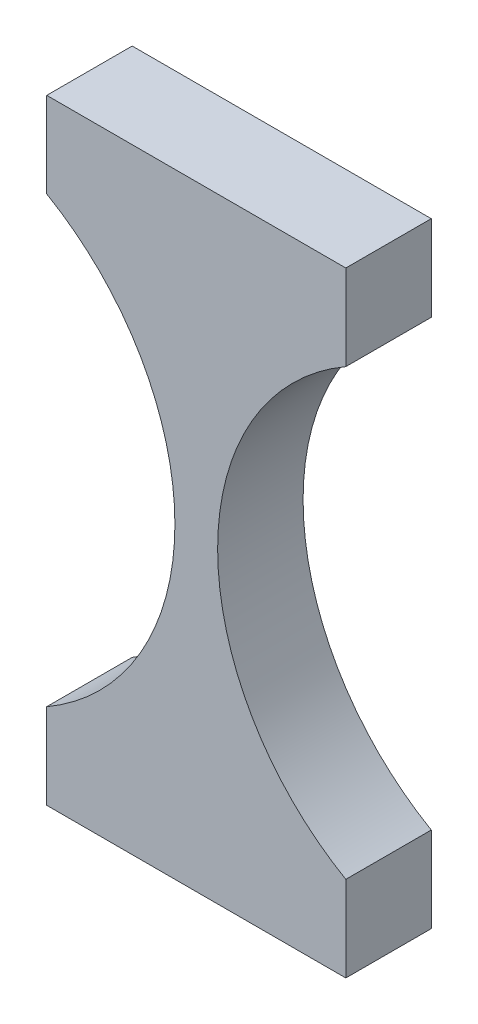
ISO-10303-21;
HEADER;
FILE_DESCRIPTION(('STEP AP214'),'2;1');
FILE_NAME('part.step','',(''),(''),'','','');
FILE_SCHEMA(('AUTOMOTIVE_DESIGN { 1 0 10303 214 1 1 1 1 }'));
ENDSEC;
DATA;
#1=APPLICATION_CONTEXT('core data for automotive mechanical design processes');
#2=APPLICATION_PROTOCOL_DEFINITION('international standard','automotive_design',2000,#1);
#3=PRODUCT_CONTEXT('',#1,'mechanical');
#4=PRODUCT('Part','Part','',(#3));
#5=PRODUCT_RELATED_PRODUCT_CATEGORY('part','',(#4));
#6=PRODUCT_DEFINITION_FORMATION('','',#4);
#7=PRODUCT_DEFINITION_CONTEXT('part definition',#1,'design');
#8=PRODUCT_DEFINITION('design','',#6,#7);
#9=PRODUCT_DEFINITION_SHAPE('','',#8);
#10=(LENGTH_UNIT() NAMED_UNIT(*) SI_UNIT(.MILLI.,.METRE.));
#11=(NAMED_UNIT(*) PLANE_ANGLE_UNIT() SI_UNIT($,.RADIAN.));
#12=(NAMED_UNIT(*) SI_UNIT($,.STERADIAN.) SOLID_ANGLE_UNIT());
#13=UNCERTAINTY_MEASURE_WITH_UNIT(LENGTH_MEASURE(1.E-05),#10,'distance_accuracy_value','');
#14=(GEOMETRIC_REPRESENTATION_CONTEXT(3) GLOBAL_UNCERTAINTY_ASSIGNED_CONTEXT((#13)) GLOBAL_UNIT_ASSIGNED_CONTEXT((#10,
#11,#12)) REPRESENTATION_CONTEXT('',''));
#15=CARTESIAN_POINT('',(0.,0.,0.));
#16=DIRECTION('',(0.,0.,1.));
#17=DIRECTION('',(1.,0.,0.));
#18=AXIS2_PLACEMENT_3D('',#15,#16,#17);
#19=CARTESIAN_POINT('',(-3.25,0.,1.));
#20=DIRECTION('',(0.,0.,-1.));
#21=DIRECTION('',(-1.,0.,0.));
#22=AXIS2_PLACEMENT_3D('',#19,#20,#21);
#23=CYLINDRICAL_SURFACE('',#22,3.);
#24=CARTESIAN_POINT('',(-3.25,0.,0.));
#25=DIRECTION('',(0.,0.,-1.));
#26=DIRECTION('',(-1.,0.,0.));
#27=AXIS2_PLACEMENT_3D('',#24,#25,#26);
#28=CIRCLE('',#27,3.);
#29=CARTESIAN_POINT('',(-1.75,2.59807621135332,0.));
#30=VERTEX_POINT('',#29);
#31=CARTESIAN_POINT('',(-1.75,-2.59807621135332,0.));
#32=VERTEX_POINT('',#31);
#33=EDGE_CURVE('E140',#30,#32,#28,.T.);
#34=ORIENTED_EDGE('',*,*,#33,.T.);
#35=DIRECTION('',(0.,0.,-1.));
#36=VECTOR('',#35,1.);
#37=CARTESIAN_POINT('',(-1.75,-2.59807621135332,1.));
#38=LINE('',#37,#36);
#39=CARTESIAN_POINT('',(-1.75,-2.59807621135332,1.));
#40=VERTEX_POINT('',#39);
#41=EDGE_CURVE('E11',#40,#32,#38,.T.);
#42=ORIENTED_EDGE('',*,*,#41,.F.);
#43=CARTESIAN_POINT('',(-3.25,0.,1.));
#44=DIRECTION('',(0.,0.,-1.));
#45=DIRECTION('',(-1.,0.,0.));
#46=AXIS2_PLACEMENT_3D('',#43,#44,#45);
#47=CIRCLE('',#46,3.);
#48=CARTESIAN_POINT('',(-1.75,2.59807621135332,1.));
#49=VERTEX_POINT('',#48);
#50=EDGE_CURVE('E162',#49,#40,#47,.T.);
#51=ORIENTED_EDGE('',*,*,#50,.F.);
#52=DIRECTION('',(0.,0.,-1.));
#53=VECTOR('',#52,1.);
#54=CARTESIAN_POINT('',(-1.75,2.59807621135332,1.));
#55=LINE('',#54,#53);
#56=EDGE_CURVE('E136',#49,#30,#55,.T.);
#57=ORIENTED_EDGE('',*,*,#56,.T.);
#58=EDGE_LOOP('',(#34,#42,#51,#57));
#59=FACE_BOUND('',#58,.T.);
#60=ADVANCED_FACE('F39',(#59),#23,.F.);
#61=CARTESIAN_POINT('',(-1.75,-2.59807621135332,1.));
#62=DIRECTION('',(1.,0.,0.));
#63=DIRECTION('',(0.,1.,0.));
#64=AXIS2_PLACEMENT_3D('',#61,#62,#63);
#65=PLANE('',#64);
#66=DIRECTION('',(0.,-1.,0.));
#67=VECTOR('',#66,1.);
#68=CARTESIAN_POINT('',(-1.75,-2.59807621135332,0.));
#69=LINE('',#68,#67);
#70=CARTESIAN_POINT('',(-1.75,-3.59807621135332,0.));
#71=VERTEX_POINT('',#70);
#72=EDGE_CURVE('E144',#32,#71,#69,.T.);
#73=ORIENTED_EDGE('',*,*,#72,.T.);
#74=DIRECTION('',(0.,0.,-1.));
#75=VECTOR('',#74,1.);
#76=CARTESIAN_POINT('',(-1.75,-3.59807621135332,1.));
#77=LINE('',#76,#75);
#78=CARTESIAN_POINT('',(-1.75,-3.59807621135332,1.));
#79=VERTEX_POINT('',#78);
#80=EDGE_CURVE('E48',#79,#71,#77,.T.);
#81=ORIENTED_EDGE('',*,*,#80,.F.);
#82=DIRECTION('',(0.,-1.,0.));
#83=VECTOR('',#82,1.);
#84=CARTESIAN_POINT('',(-1.75,-2.59807621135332,1.));
#85=LINE('',#84,#83);
#86=EDGE_CURVE('E99',#40,#79,#85,.T.);
#87=ORIENTED_EDGE('',*,*,#86,.F.);
#88=ORIENTED_EDGE('',*,*,#41,.T.);
#89=EDGE_LOOP('',(#73,#81,#87,#88));
#90=FACE_BOUND('',#89,.T.);
#91=ADVANCED_FACE('F208',(#90),#65,.F.);
#92=CARTESIAN_POINT('',(-1.75,-3.59807621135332,1.));
#93=DIRECTION('',(0.,1.,0.));
#94=DIRECTION('',(0.,0.,1.));
#95=AXIS2_PLACEMENT_3D('',#92,#93,#94);
#96=PLANE('',#95);
#97=DIRECTION('',(1.,0.,0.));
#98=VECTOR('',#97,1.);
#99=CARTESIAN_POINT('',(-1.75,-3.59807621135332,0.));
#100=LINE('',#99,#98);
#101=CARTESIAN_POINT('',(1.75,-3.59807621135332,0.));
#102=VERTEX_POINT('',#101);
#103=EDGE_CURVE('E147',#71,#102,#100,.T.);
#104=ORIENTED_EDGE('',*,*,#103,.T.);
#105=DIRECTION('',(0.,0.,-1.));
#106=VECTOR('',#105,1.);
#107=CARTESIAN_POINT('',(1.75,-3.59807621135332,1.));
#108=LINE('',#107,#106);
#109=CARTESIAN_POINT('',(1.75,-3.59807621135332,1.));
#110=VERTEX_POINT('',#109);
#111=EDGE_CURVE('E173',#110,#102,#108,.T.);
#112=ORIENTED_EDGE('',*,*,#111,.F.);
#113=DIRECTION('',(1.,0.,0.));
#114=VECTOR('',#113,1.);
#115=CARTESIAN_POINT('',(-1.75,-3.59807621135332,1.));
#116=LINE('',#115,#114);
#117=EDGE_CURVE('E183',#79,#110,#116,.T.);
#118=ORIENTED_EDGE('',*,*,#117,.F.);
#119=ORIENTED_EDGE('',*,*,#80,.T.);
#120=EDGE_LOOP('',(#104,#112,#118,#119));
#121=FACE_BOUND('',#120,.T.);
#122=ADVANCED_FACE('F181',(#121),#96,.F.);
#123=CARTESIAN_POINT('',(1.75,-2.59807621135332,1.));
#124=DIRECTION('',(-1.,0.,0.));
#125=DIRECTION('',(0.,-1.,0.));
#126=AXIS2_PLACEMENT_3D('',#123,#124,#125);
#127=PLANE('',#126);
#128=DIRECTION('',(0.,1.,0.));
#129=VECTOR('',#128,1.);
#130=CARTESIAN_POINT('',(1.75,-2.59807621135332,0.));
#131=LINE('',#130,#129);
#132=CARTESIAN_POINT('',(1.75,-2.59807621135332,0.));
#133=VERTEX_POINT('',#132);
#134=EDGE_CURVE('E150',#102,#133,#131,.T.);
#135=ORIENTED_EDGE('',*,*,#134,.T.);
#136=DIRECTION('',(0.,0.,-1.));
#137=VECTOR('',#136,1.);
#138=CARTESIAN_POINT('',(1.75,-2.59807621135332,1.));
#139=LINE('',#138,#137);
#140=CARTESIAN_POINT('',(1.75,-2.59807621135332,1.));
#141=VERTEX_POINT('',#140);
#142=EDGE_CURVE('E169',#141,#133,#139,.T.);
#143=ORIENTED_EDGE('',*,*,#142,.F.);
#144=DIRECTION('',(0.,1.,0.));
#145=VECTOR('',#144,1.);
#146=CARTESIAN_POINT('',(1.75,-2.59807621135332,1.));
#147=LINE('',#146,#145);
#148=EDGE_CURVE('E196',#110,#141,#147,.T.);
#149=ORIENTED_EDGE('',*,*,#148,.F.);
#150=ORIENTED_EDGE('',*,*,#111,.T.);
#151=EDGE_LOOP('',(#135,#143,#149,#150));
#152=FACE_BOUND('',#151,.T.);
#153=ADVANCED_FACE('F191',(#152),#127,.F.);
#154=CARTESIAN_POINT('',(3.25,0.,1.));
#155=DIRECTION('',(0.,0.,-1.));
#156=DIRECTION('',(-1.,0.,0.));
#157=AXIS2_PLACEMENT_3D('',#154,#155,#156);
#158=CYLINDRICAL_SURFACE('',#157,3.);
#159=CARTESIAN_POINT('',(3.25,0.,0.));
#160=DIRECTION('',(0.,0.,-1.));
#161=DIRECTION('',(1.,0.,0.));
#162=AXIS2_PLACEMENT_3D('',#159,#160,#161);
#163=CIRCLE('',#162,3.);
#164=CARTESIAN_POINT('',(1.75,2.59807621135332,0.));
#165=VERTEX_POINT('',#164);
#166=EDGE_CURVE('E153',#133,#165,#163,.T.);
#167=ORIENTED_EDGE('',*,*,#166,.T.);
#168=DIRECTION('',(0.,0.,-1.));
#169=VECTOR('',#168,1.);
#170=CARTESIAN_POINT('',(1.75,2.59807621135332,1.));
#171=LINE('',#170,#169);
#172=CARTESIAN_POINT('',(1.75,2.59807621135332,1.));
#173=VERTEX_POINT('',#172);
#174=EDGE_CURVE('E129',#173,#165,#171,.T.);
#175=ORIENTED_EDGE('',*,*,#174,.F.);
#176=CARTESIAN_POINT('',(3.25,0.,1.));
#177=DIRECTION('',(0.,0.,-1.));
#178=DIRECTION('',(1.,0.,0.));
#179=AXIS2_PLACEMENT_3D('',#176,#177,#178);
#180=CIRCLE('',#179,3.);
#181=EDGE_CURVE('E118',#141,#173,#180,.T.);
#182=ORIENTED_EDGE('',*,*,#181,.F.);
#183=ORIENTED_EDGE('',*,*,#142,.T.);
#184=EDGE_LOOP('',(#167,#175,#182,#183));
#185=FACE_BOUND('',#184,.T.);
#186=ADVANCED_FACE('F194',(#185),#158,.F.);
#187=CARTESIAN_POINT('',(1.75,3.59807621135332,1.));
#188=DIRECTION('',(-1.,0.,0.));
#189=DIRECTION('',(0.,-1.,0.));
#190=AXIS2_PLACEMENT_3D('',#187,#188,#189);
#191=PLANE('',#190);
#192=DIRECTION('',(0.,1.,0.));
#193=VECTOR('',#192,1.);
#194=CARTESIAN_POINT('',(1.75,3.59807621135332,0.));
#195=LINE('',#194,#193);
#196=CARTESIAN_POINT('',(1.75,3.59807621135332,0.));
#197=VERTEX_POINT('',#196);
#198=EDGE_CURVE('E127',#165,#197,#195,.T.);
#199=ORIENTED_EDGE('',*,*,#198,.T.);
#200=DIRECTION('',(0.,0.,-1.));
#201=VECTOR('',#200,1.);
#202=CARTESIAN_POINT('',(1.75,3.59807621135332,1.));
#203=LINE('',#202,#201);
#204=CARTESIAN_POINT('',(1.75,3.59807621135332,1.));
#205=VERTEX_POINT('',#204);
#206=EDGE_CURVE('E124',#205,#197,#203,.T.);
#207=ORIENTED_EDGE('',*,*,#206,.F.);
#208=DIRECTION('',(0.,1.,0.));
#209=VECTOR('',#208,1.);
#210=CARTESIAN_POINT('',(1.75,3.59807621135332,1.));
#211=LINE('',#210,#209);
#212=EDGE_CURVE('E112',#173,#205,#211,.T.);
#213=ORIENTED_EDGE('',*,*,#212,.F.);
#214=ORIENTED_EDGE('',*,*,#174,.T.);
#215=EDGE_LOOP('',(#199,#207,#213,#214));
#216=FACE_BOUND('',#215,.T.);
#217=ADVANCED_FACE('F125',(#216),#191,.F.);
#218=CARTESIAN_POINT('',(-1.75,3.59807621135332,1.));
#219=DIRECTION('',(0.,-1.,0.));
#220=DIRECTION('',(0.,0.,-1.));
#221=AXIS2_PLACEMENT_3D('',#218,#219,#220);
#222=PLANE('',#221);
#223=DIRECTION('',(-1.,0.,0.));
#224=VECTOR('',#223,1.);
#225=CARTESIAN_POINT('',(-1.75,3.59807621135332,0.));
#226=LINE('',#225,#224);
#227=CARTESIAN_POINT('',(-1.75,3.59807621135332,0.));
#228=VERTEX_POINT('',#227);
#229=EDGE_CURVE('E85',#197,#228,#226,.T.);
#230=ORIENTED_EDGE('',*,*,#229,.T.);
#231=DIRECTION('',(0.,0.,-1.));
#232=VECTOR('',#231,1.);
#233=CARTESIAN_POINT('',(-1.75,3.59807621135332,1.));
#234=LINE('',#233,#232);
#235=CARTESIAN_POINT('',(-1.75,3.59807621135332,1.));
#236=VERTEX_POINT('',#235);
#237=EDGE_CURVE('E130',#236,#228,#234,.T.);
#238=ORIENTED_EDGE('',*,*,#237,.F.);
#239=DIRECTION('',(-1.,0.,0.));
#240=VECTOR('',#239,1.);
#241=CARTESIAN_POINT('',(-1.75,3.59807621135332,1.));
#242=LINE('',#241,#240);
#243=EDGE_CURVE('E116',#205,#236,#242,.T.);
#244=ORIENTED_EDGE('',*,*,#243,.F.);
#245=ORIENTED_EDGE('',*,*,#206,.T.);
#246=EDGE_LOOP('',(#230,#238,#244,#245));
#247=FACE_BOUND('',#246,.T.);
#248=ADVANCED_FACE('F132',(#247),#222,.F.);
#249=CARTESIAN_POINT('',(-1.75,3.59807621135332,1.));
#250=DIRECTION('',(1.,0.,0.));
#251=DIRECTION('',(0.,1.,0.));
#252=AXIS2_PLACEMENT_3D('',#249,#250,#251);
#253=PLANE('',#252);
#254=DIRECTION('',(0.,-1.,0.));
#255=VECTOR('',#254,1.);
#256=CARTESIAN_POINT('',(-1.75,3.59807621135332,0.));
#257=LINE('',#256,#255);
#258=EDGE_CURVE('E91',#228,#30,#257,.T.);
#259=ORIENTED_EDGE('',*,*,#258,.T.);
#260=ORIENTED_EDGE('',*,*,#56,.F.);
#261=DIRECTION('',(0.,-1.,0.));
#262=VECTOR('',#261,1.);
#263=CARTESIAN_POINT('',(-1.75,3.59807621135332,1.));
#264=LINE('',#263,#262);
#265=EDGE_CURVE('E56',#236,#49,#264,.T.);
#266=ORIENTED_EDGE('',*,*,#265,.F.);
#267=ORIENTED_EDGE('',*,*,#237,.T.);
#268=EDGE_LOOP('',(#259,#260,#266,#267));
#269=FACE_BOUND('',#268,.T.);
#270=ADVANCED_FACE('F224',(#269),#253,.F.);
#271=CARTESIAN_POINT('',(-3.25,0.,1.));
#272=DIRECTION('',(0.,0.,-1.));
#273=DIRECTION('',(-1.,0.,0.));
#274=AXIS2_PLACEMENT_3D('',#271,#272,#273);
#275=PLANE('',#274);
#276=ORIENTED_EDGE('',*,*,#50,.T.);
#277=ORIENTED_EDGE('',*,*,#86,.T.);
#278=ORIENTED_EDGE('',*,*,#117,.T.);
#279=ORIENTED_EDGE('',*,*,#148,.T.);
#280=ORIENTED_EDGE('',*,*,#181,.T.);
#281=ORIENTED_EDGE('',*,*,#212,.T.);
#282=ORIENTED_EDGE('',*,*,#243,.T.);
#283=ORIENTED_EDGE('',*,*,#265,.T.);
#284=EDGE_LOOP('',(#276,#277,#278,#279,#280,#281,#282,#283));
#285=FACE_BOUND('',#284,.T.);
#286=ADVANCED_FACE('F114',(#285),#275,.F.);
#287=CARTESIAN_POINT('',(-3.25,0.,0.));
#288=DIRECTION('',(0.,0.,-1.));
#289=DIRECTION('',(-1.,0.,0.));
#290=AXIS2_PLACEMENT_3D('',#287,#288,#289);
#291=PLANE('',#290);
#292=ORIENTED_EDGE('',*,*,#33,.F.);
#293=ORIENTED_EDGE('',*,*,#258,.F.);
#294=ORIENTED_EDGE('',*,*,#229,.F.);
#295=ORIENTED_EDGE('',*,*,#198,.F.);
#296=ORIENTED_EDGE('',*,*,#166,.F.);
#297=ORIENTED_EDGE('',*,*,#134,.F.);
#298=ORIENTED_EDGE('',*,*,#103,.F.);
#299=ORIENTED_EDGE('',*,*,#72,.F.);
#300=EDGE_LOOP('',(#292,#293,#294,#295,#296,#297,#298,#299));
#301=FACE_BOUND('',#300,.T.);
#302=ADVANCED_FACE('F187',(#301),#291,.T.);
#303=CLOSED_SHELL('',(#60,#91,#122,#153,#186,#217,#248,#270,#286,#302));
#304=MANIFOLD_SOLID_BREP('B2',#303);
#305=ADVANCED_BREP_SHAPE_REPRESENTATION('',(#18,#304),#14);
#306=SHAPE_DEFINITION_REPRESENTATION(#9,#305);
ENDSEC;
END-ISO-10303-21;
